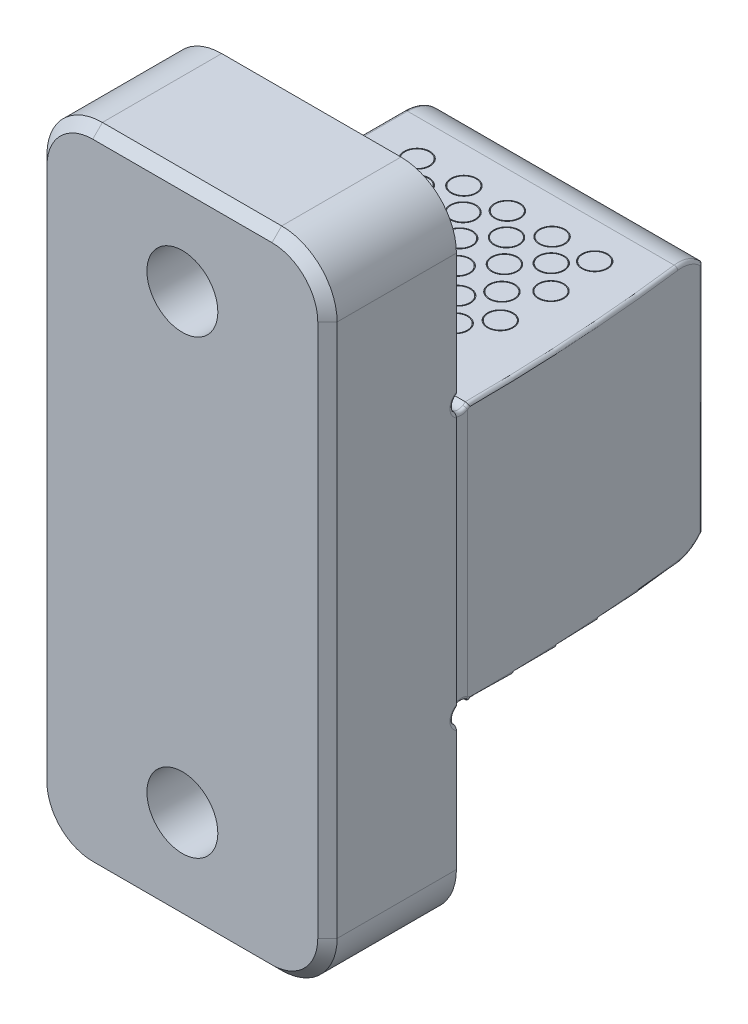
from build123d import *

# Parameters (mm, degrees)
EXTRUDE1_DEPTH                  = 22.5
SKETCH7_W                       = 52.643505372
SKETCH7_H                       = 100
CUT_EXTRUDE3_DEPTH              = 0.25
SKETCH8_R                       = 1.5
CUT_EXTRUDE4_DEPTH              = 79.866779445
CUT_EXTRUDE5_DEPTH              = 79.866779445
CUT_EXTRUDE6_DEPTH              = 111.459127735
SKETCH15_R                      = 2
SKETCH15_R_2                    = 1.87
CUT_EXTRUDE7_DEPTH              = 0.254
CBORE_FOR_M10_SHCS1_D           = 11
CBORE_FOR_M10_SHCS1_CBORE_D     = 18
CBORE_FOR_M10_SHCS1_CBORE_DEPTH = 11
FILLET1_R                       = 8.6
CHAMFER1_SIZE                   = 1.5
CHAMFER2_SIZE                   = 0.4
FILLET2_R                       = 0.5


with BuildPart() as part:
    # Sketch3 → Extrude1 (new, symmetric)
    with BuildSketch(Plane(origin=(0, 0, 0), x_dir=(0, 0, -1), z_dir=(1, 0, 0))):
        Polygon((-20, -50), (0, -50), (0, -19.9975), (41.17, -19.9975), (41.17, 19.9975), (0, 19.9975), (0, 50), (-20, 50), align=None)
    extrude(amount=EXTRUDE1_DEPTH, both=True)

    # Sketch7 → Cut-Extrude3 (cut)
    with BuildSketch(Plane(origin=(22.5, 0, 0), x_dir=(0, 0, -1), z_dir=(1, 0, 0))):
        with Locations((26.321752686, 0)):
            Rectangle(SKETCH7_W, SKETCH7_H)
    cut_extrude3 = extrude(amount=-CUT_EXTRUDE3_DEPTH, mode=Mode.SUBTRACT)

    # Sketch8 → Cut-Extrude4 (cut, through all)
    with BuildSketch(Plane(origin=(22.5, 0, 0), x_dir=(0, 0, -1), z_dir=(1, 0, 0))):
        with Locations((1, 20.9975)):
            Circle(SKETCH8_R)
        with Locations((1, -20.9975)):
            Circle(SKETCH8_R)
    extrude(amount=-CUT_EXTRUDE4_DEPTH, mode=Mode.SUBTRACT)

    # Sketch9 → Cut-Extrude5 (cut, through all)
    with BuildSketch(Plane(origin=(22.5, 0, 0), x_dir=(0, 0, -1), z_dir=(1, 0, 0))):
        with BuildLine():
            Line((41.17, 18.080505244), (46.67, 18.080505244))
            Line((46.67, 18.080505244), (46.67, 28.080505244))
            Line((46.67, 28.080505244), (36.67, 28.080505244))
            Line((36.67, 28.080505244), (36.67, 19.9975))
            ThreePointArc((36.67, 19.9975), (39.115652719, 19.498282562), (41.17, 18.080505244))
        make_face()
        with BuildLine():
            Line((46.67, -18.080505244), (46.67, -28.080505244))
            Line((46.67, -28.080505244), (36.67, -28.080505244))
            Line((36.67, -28.080505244), (36.67, -19.9975))
            ThreePointArc((36.67, -19.9975), (39.115652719, -19.498282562), (41.17, -18.080505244))
            Line((41.17, -18.080505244), (46.67, -18.080505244))
        make_face()
    extrude(amount=-CUT_EXTRUDE5_DEPTH, mode=Mode.SUBTRACT)

    # Sketch13 → Cut-Extrude6 (cut, through all)
    with BuildSketch(Plane(origin=(0, 50, 0), x_dir=(1, 0, 0), z_dir=(0, 1, 0))):
        with BuildLine():
            Line((17.749546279, 52), (67.749546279, 52))
            Line((67.749546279, 52), (67.749546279, 2))
            Line((67.749546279, 2), (22.25, 2))
            ThreePointArc((22.25, 2), (21.12261694, 27.101066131), (17.749546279, 52))
        make_face()
    extrude(amount=-CUT_EXTRUDE6_DEPTH, mode=Mode.SUBTRACT)

    # Sketch15 → Cut-Extrude7 (cut)
    # profile 1 of 27: a face of its own
    with BuildSketch(Plane(origin=(0, 19.9975, 0), x_dir=(1, 0, 0), z_dir=(0, 1, 0))):
        with Locations(Location((12.923018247, 31.024385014, 0), (0, 0, 270))):
            Circle(SKETCH15_R)
        with Locations(Location((12.923018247, 31.024385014, 0), (0, 0, 270))):
            Circle(SKETCH15_R_2, mode=Mode.SUBTRACT)
    # profile 2 of 27: a face of its own
    with BuildSketch(Plane(origin=(0, 19.9975, 0), x_dir=(1, 0, 0), z_dir=(0, 1, 0))):
        with Locations(Location((-0.62384496, 31.024385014, 0), (0, 0, 270))):
            Circle(SKETCH15_R)
        with Locations(Location((-0.62384496, 31.024385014, 0), (0, 0, 270))):
            Circle(SKETCH15_R_2, mode=Mode.SUBTRACT)
    # profile 3 of 27: a face of its own
    with BuildSketch(Plane(origin=(0, 19.9975, 0), x_dir=(1, 0, 0), z_dir=(0, 1, 0))):
        with Locations(Location((-14.624430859, 31.024385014, 0), (0, 0, 270))):
            Circle(SKETCH15_R)
        with Locations(Location((-14.624430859, 31.024385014, 0), (0, 0, 270))):
            Circle(SKETCH15_R_2, mode=Mode.SUBTRACT)
    # profile 4 of 27: a face of its own
    with BuildSketch(Plane(origin=(0, 19.9975, 0), x_dir=(1, 0, 0), z_dir=(0, 1, 0))):
        with Locations(Location((-7.3648678, 31.024385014, 0), (0, 0, 270))):
            Circle(SKETCH15_R)
        with Locations(Location((-7.3648678, 31.024385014, 0), (0, 0, 270))):
            Circle(SKETCH15_R_2, mode=Mode.SUBTRACT)
    # profile 5 of 27: a face of its own
    with BuildSketch(Plane(origin=(0, 19.9975, 0), x_dir=(1, 0, 0), z_dir=(0, 1, 0))):
        with Locations(Location((6.311630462, 31.024385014, 0), (0, 0, 270))):
            Circle(SKETCH15_R)
        with Locations(Location((6.311630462, 31.024385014, 0), (0, 0, 270))):
            Circle(SKETCH15_R_2, mode=Mode.SUBTRACT)
    # profile 6 of 27: a face of its own
    with BuildSketch(Plane(origin=(0, 19.9975, 0), x_dir=(1, 0, 0), z_dir=(0, 1, 0))):
        with Locations(Location((13.532941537, 15.776302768, 0), (0, 0, 270))):
            Circle(SKETCH15_R)
        with Locations(Location((13.532941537, 15.776302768, 0), (0, 0, 270))):
            Circle(SKETCH15_R_2, mode=Mode.SUBTRACT)
    # profile 7 of 27: a face of its own
    with BuildSketch(Plane(origin=(0, 19.9975, 0), x_dir=(1, 0, 0), z_dir=(0, 1, 0))):
        with Locations(Location((2.876301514, 27.394603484, 0), (0, 0, 270))):
            Circle(SKETCH15_R)
        with Locations(Location((2.876301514, 27.394603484, 0), (0, 0, 270))):
            Circle(SKETCH15_R_2, mode=Mode.SUBTRACT)
    # profile 8 of 27: a face of its own
    with BuildSketch(Plane(origin=(0, 19.9975, 0), x_dir=(1, 0, 0), z_dir=(0, 1, 0))):
        with Locations(Location((-11.124284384, 27.394603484, 0), (0, 0, 270))):
            Circle(SKETCH15_R)
        with Locations(Location((-11.124284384, 27.394603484, 0), (0, 0, 270))):
            Circle(SKETCH15_R_2, mode=Mode.SUBTRACT)
    # profile 9 of 27: a face of its own
    with BuildSketch(Plane(origin=(0, 19.9975, 0), x_dir=(1, 0, 0), z_dir=(0, 1, 0))):
        with Locations(Location((-3.864721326, 27.394603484, 0), (0, 0, 270))):
            Circle(SKETCH15_R)
        with Locations(Location((-3.864721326, 27.394603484, 0), (0, 0, 270))):
            Circle(SKETCH15_R_2, mode=Mode.SUBTRACT)
    # profile 10 of 27: a face of its own
    with BuildSketch(Plane(origin=(0, 19.9975, 0), x_dir=(1, 0, 0), z_dir=(0, 1, 0))):
        with Locations(Location((9.811776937, 27.394603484, 0), (0, 0, 270))):
            Circle(SKETCH15_R)
        with Locations(Location((9.811776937, 27.394603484, 0), (0, 0, 270))):
            Circle(SKETCH15_R_2, mode=Mode.SUBTRACT)
    # profile 11 of 27: a face of its own
    with BuildSketch(Plane(origin=(0, 19.9975, 0), x_dir=(1, 0, 0), z_dir=(0, 1, 0))):
        with Locations(Location((13.532941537, 23.6351869, 0), (0, 0, 270))):
            Circle(SKETCH15_R)
        with Locations(Location((13.532941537, 23.6351869, 0), (0, 0, 270))):
            Circle(SKETCH15_R_2, mode=Mode.SUBTRACT)
    # profile 12 of 27: a face of its own
    with BuildSketch(Plane(origin=(0, 19.9975, 0), x_dir=(1, 0, 0), z_dir=(0, 1, 0))):
        with Locations(Location((-0.62384496, 23.6351869, 0), (0, 0, 270))):
            Circle(SKETCH15_R)
        with Locations(Location((-0.62384496, 23.6351869, 0), (0, 0, 270))):
            Circle(SKETCH15_R_2, mode=Mode.SUBTRACT)
    # profile 13 of 27: a face of its own
    with BuildSketch(Plane(origin=(0, 19.9975, 0), x_dir=(1, 0, 0), z_dir=(0, 1, 0))):
        with Locations(Location((-14.624430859, 23.6351869, 0), (0, 0, 270))):
            Circle(SKETCH15_R)
        with Locations(Location((-14.624430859, 23.6351869, 0), (0, 0, 270))):
            Circle(SKETCH15_R_2, mode=Mode.SUBTRACT)
    # profile 14 of 27: a face of its own
    with BuildSketch(Plane(origin=(0, 19.9975, 0), x_dir=(1, 0, 0), z_dir=(0, 1, 0))):
        with Locations(Location((-7.3648678, 23.6351869, 0), (0, 0, 270))):
            Circle(SKETCH15_R)
        with Locations(Location((-7.3648678, 23.6351869, 0), (0, 0, 270))):
            Circle(SKETCH15_R_2, mode=Mode.SUBTRACT)
    # profile 15 of 27: a face of its own
    with BuildSketch(Plane(origin=(0, 19.9975, 0), x_dir=(1, 0, 0), z_dir=(0, 1, 0))):
        with Locations(Location((6.311630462, 23.6351869, 0), (0, 0, 270))):
            Circle(SKETCH15_R)
        with Locations(Location((6.311630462, 23.6351869, 0), (0, 0, 270))):
            Circle(SKETCH15_R_2, mode=Mode.SUBTRACT)
    # profile 16 of 27: a face of its own
    with BuildSketch(Plane(origin=(0, 19.9975, 0), x_dir=(1, 0, 0), z_dir=(0, 1, 0))):
        with Locations(Location((-0.01392167, 15.776302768, 0), (0, 0, 270))):
            Circle(SKETCH15_R)
        with Locations(Location((-0.01392167, 15.776302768, 0), (0, 0, 270))):
            Circle(SKETCH15_R_2, mode=Mode.SUBTRACT)
    # profile 17 of 27: a face of its own
    with BuildSketch(Plane(origin=(0, 19.9975, 0), x_dir=(1, 0, 0), z_dir=(0, 1, 0))):
        with Locations(Location((2.876301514, 19.746135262, 0), (0, 0, 270))):
            Circle(SKETCH15_R)
        with Locations(Location((2.876301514, 19.746135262, 0), (0, 0, 270))):
            Circle(SKETCH15_R_2, mode=Mode.SUBTRACT)
    # profile 18 of 27: a face of its own
    with BuildSketch(Plane(origin=(0, 19.9975, 0), x_dir=(1, 0, 0), z_dir=(0, 1, 0))):
        with Locations(Location((-11.124284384, 19.746135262, 0), (0, 0, 270))):
            Circle(SKETCH15_R)
        with Locations(Location((-11.124284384, 19.746135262, 0), (0, 0, 270))):
            Circle(SKETCH15_R_2, mode=Mode.SUBTRACT)
    # profile 19 of 27: a face of its own
    with BuildSketch(Plane(origin=(0, 19.9975, 0), x_dir=(1, 0, 0), z_dir=(0, 1, 0))):
        with Locations(Location((-3.864721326, 19.746135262, 0), (0, 0, 270))):
            Circle(SKETCH15_R)
        with Locations(Location((-3.864721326, 19.746135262, 0), (0, 0, 270))):
            Circle(SKETCH15_R_2, mode=Mode.SUBTRACT)
    # profile 20 of 27: a face of its own
    with BuildSketch(Plane(origin=(0, 19.9975, 0), x_dir=(1, 0, 0), z_dir=(0, 1, 0))):
        with Locations(Location((9.811776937, 19.746135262, 0), (0, 0, 270))):
            Circle(SKETCH15_R)
        with Locations(Location((9.811776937, 19.746135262, 0), (0, 0, 270))):
            Circle(SKETCH15_R_2, mode=Mode.SUBTRACT)
    # profile 21 of 27: a face of its own
    with BuildSketch(Plane(origin=(0, 19.9975, 0), x_dir=(1, 0, 0), z_dir=(0, 1, 0))):
        with Locations(Location((-14.014507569, 15.776302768, 0), (0, 0, 270))):
            Circle(SKETCH15_R)
        with Locations(Location((-14.014507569, 15.776302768, 0), (0, 0, 270))):
            Circle(SKETCH15_R_2, mode=Mode.SUBTRACT)
    # profile 22 of 27: a face of its own
    with BuildSketch(Plane(origin=(0, 19.9975, 0), x_dir=(1, 0, 0), z_dir=(0, 1, 0))):
        with Locations(Location((-6.754944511, 15.776302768, 0), (0, 0, 270))):
            Circle(SKETCH15_R)
        with Locations(Location((-6.754944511, 15.776302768, 0), (0, 0, 270))):
            Circle(SKETCH15_R_2, mode=Mode.SUBTRACT)
    # profile 23 of 27: a face of its own
    with BuildSketch(Plane(origin=(0, 19.9975, 0), x_dir=(1, 0, 0), z_dir=(0, 1, 0))):
        with Locations(Location((6.921553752, 15.776302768, 0), (0, 0, 270))):
            Circle(SKETCH15_R)
        with Locations(Location((6.921553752, 15.776302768, 0), (0, 0, 270))):
            Circle(SKETCH15_R_2, mode=Mode.SUBTRACT)
    # profile 24 of 27: a face of its own
    with BuildSketch(Plane(origin=(0, 19.9975, 0), x_dir=(1, 0, 0), z_dir=(0, 1, 0))):
        with Locations(Location((3.486224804, 11.88725113, 0), (0, 0, 270))):
            Circle(SKETCH15_R)
        with Locations(Location((3.486224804, 11.88725113, 0), (0, 0, 270))):
            Circle(SKETCH15_R_2, mode=Mode.SUBTRACT)
    # profile 25 of 27: a face of its own
    with BuildSketch(Plane(origin=(0, 19.9975, 0), x_dir=(1, 0, 0), z_dir=(0, 1, 0))):
        with Locations(Location((-10.514361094, 11.88725113, 0), (0, 0, 270))):
            Circle(SKETCH15_R)
        with Locations(Location((-10.514361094, 11.88725113, 0), (0, 0, 270))):
            Circle(SKETCH15_R_2, mode=Mode.SUBTRACT)
    # profile 26 of 27: a face of its own
    with BuildSketch(Plane(origin=(0, 19.9975, 0), x_dir=(1, 0, 0), z_dir=(0, 1, 0))):
        with Locations(Location((-3.254798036, 11.88725113, 0), (0, 0, 270))):
            Circle(SKETCH15_R)
        with Locations(Location((-3.254798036, 11.88725113, 0), (0, 0, 270))):
            Circle(SKETCH15_R_2, mode=Mode.SUBTRACT)
    # profile 27 of 27: a face of its own
    with BuildSketch(Plane(origin=(0, 19.9975, 0), x_dir=(1, 0, 0), z_dir=(0, 1, 0))):
        with Locations(Location((10.421700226, 11.88725113, 0), (0, 0, 270))):
            Circle(SKETCH15_R)
        with Locations(Location((10.421700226, 11.88725113, 0), (0, 0, 270))):
            Circle(SKETCH15_R_2, mode=Mode.SUBTRACT)
    cut_extrude7 = extrude(amount=-CUT_EXTRUDE7_DEPTH, mode=Mode.SUBTRACT)

    # Mirror1: Cut-Extrude7 across plane
    add(cut_extrude7.mirror(Plane.ZX), mode=Mode.SUBTRACT)

    # CBORE for M10 SHCS1 (through all)
    with Locations(Plane(origin=(0, 0, 0), x_dir=(-1, 0, 0), z_dir=(0, 0, -1))):
        with Locations((0, 35), (0, -35)):
            CounterBoreHole(CBORE_FOR_M10_SHCS1_D / 2, CBORE_FOR_M10_SHCS1_CBORE_D / 2, CBORE_FOR_M10_SHCS1_CBORE_DEPTH)

    # Fillet1
    fillet1_edges = [part.edges().sort_by_distance(p)[0] for p in [
        (-22.5, -50, 10),
        (22.5, 50, 10),
        (22.5, -50, 10),
        (-22.5, 50, 10),
    ]]
    fillet(fillet1_edges, radius=FILLET1_R)

    # Chamfer1
    chamfer1_edges = [part.edges().sort_by_distance(p)[0] for p in [
        (22.5, 0, 20),
        (0, -50, 20),
        (-22.5, 0, 20),
        (0, 50, 20),
        (-19.981118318, -47.481118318, 20),
        (-19.981118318, 47.481118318, 20),
        (19.981118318, 47.481118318, 20),
        (19.981118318, -47.481118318, 20),
    ]]
    chamfer(chamfer1_edges, length=CHAMFER1_SIZE)

    # Chamfer2
    chamfer2_edges = [part.edges().sort_by_distance(p)[0] for p in [
        (9, -35, 0),
        (9, 35, 0),
    ]]
    chamfer(chamfer2_edges, length=CHAMFER2_SIZE)

    # Mirror2: Cut-Extrude3 across plane
    add(cut_extrude3.mirror(Plane(origin=(0, 0, 0), x_dir=(0, 0, 1), z_dir=(1, 0, 0))), mode=Mode.SUBTRACT)

    # Fillet2
    fillet2_edges = [part.edges().sort_by_distance(p)[0] for p in [
        (19.77938746, -19.499043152, -39.113866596),
        (22.25, 19.4975, -1),
        (22.249993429, 19.93683983, -2.060660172),
        (21.707129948, 19.9975, -19.427349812),
        (19.77938746, 19.499043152, -39.113866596),
        (19.496661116, 0, -41.17),
        (21.707129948, -19.9975, -19.427349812),
        (22.249993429, -19.936839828, -2.060660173),
        (22.5, 20.9975, 0.5),
        (-22.5, 20.9975, 0.5),
        (22.375, 19.879466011, 0),
        (-22.25, -19.498282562, -39.115652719),
        (-22.5, -20.9975, 0.5),
        (-22.25, 19.9975, -19.394016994),
        (-22.25, 19.499823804, -1.083462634),
        (-22.25, -19.499823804, -1.083462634),
        (-22.25, -19.9975, -19.394016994),
        (-22.25, 0, -41.17),
        (-22.25, 19.498282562, -39.115652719),
        (-22.375, 19.879466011, 0),
        (-22.375, -19.879466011, 0),
        (22.25, -19.4975, -1),
        (22.5, -20.9975, 0.5),
        (22.375, -19.879466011, 0),
    ]]
    fillet(fillet2_edges, radius=FILLET2_R)


solid = part.part
